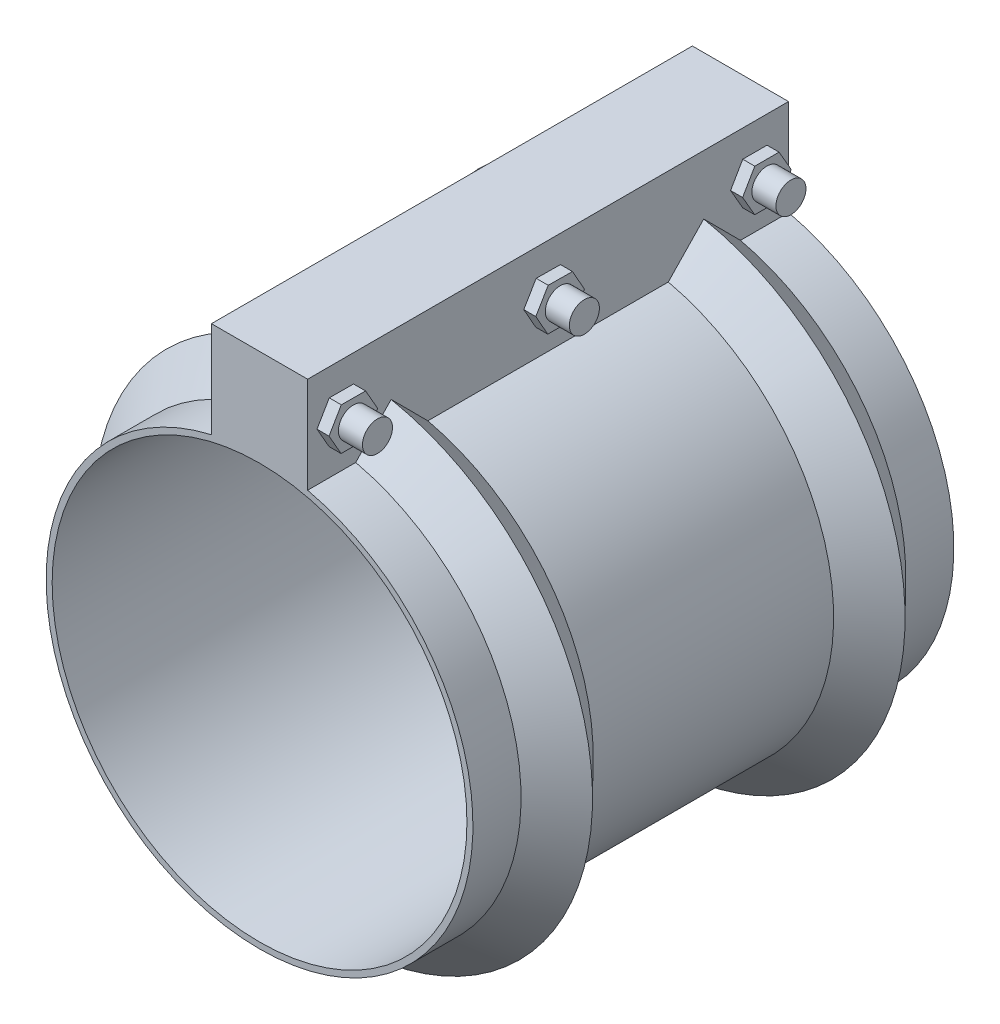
from build123d import *

# Parameters (mm, degrees)
BOSS_EXTRUDE1_DEPTH      = 127
BOSS_EXTRUDE1_DEPTH_BACK = 127
BOSS_EXTRUDE2_DEPTH      = 6.35
SKETCH4_R                = 7.9375
BOSS_EXTRUDE3_DEPTH      = 12.7
SKETCH5_R                = 11.1125
BOSS_EXTRUDE4_DEPTH      = 6.35
FILLET1_R                = 5.08


with BuildPart() as part:
    # Sketch1 → Revolve1 (revolve)
    with BuildSketch(Plane(origin=(0, 0, 0), x_dir=(0, 0, -1), z_dir=(1, 0, 0)), mode=Mode.PRIVATE) as revolve1_sk:
        Polygon((-127, 109.5375), (127, 109.5375), (127, 112.7125), (101.6, 112.7125), (82.19285338, 131.7625), (63.493427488, 112.7125), (-63.493427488, 112.7125), (-82.900574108, 131.7625), (-101.6, 112.7125), (-127, 112.7125), align=None)
    revolve(revolve1_sk.sketch.rotate(Axis((0, 0, 248.174311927), (0, 0, -1)), 90), axis=Axis((0, 0, 248.174311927), (0, 0, -1)))

    # Sketch2 → Boss-Extrude1 (add, two sides: drawn at the far end of the back side and taken through both)
    with BuildSketch(Plane.XY.offset(-BOSS_EXTRUDE1_DEPTH_BACK)):
        with BuildLine():
            Line((-25.4, 160.613239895), (25.4, 160.613239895))
            Line((25.4, 160.613239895), (25.4, 109.813239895))
            ThreePointArc((25.4, 109.813239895), (0, 112.7125), (-25.4, 109.813239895))
            Line((-25.4, 109.813239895), (-25.4, 160.613239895))
        make_face()
    extrude(amount=BOSS_EXTRUDE1_DEPTH + BOSS_EXTRUDE1_DEPTH_BACK)

    # Sketch3 → Boss-Extrude2 (add)
    with BuildSketch(Plane(origin=(25.4, 0, 0), x_dir=(0, 0, -1), z_dir=(1, 0, 0))):
        Polygon((-96.388561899, 135.14687273), (-102.746805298, 146.292407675), (-115.578243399, 146.35877484), (-122.051438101, 135.27960706), (-115.693194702, 124.134072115), (-102.861756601, 124.06770495), align=None)
        Polygon((12.830885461, 135.076907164), (6.533510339, 146.256946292), (-6.297375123, 146.393279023), (-12.830885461, 135.349572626), (-6.533510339, 124.169533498), (6.297375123, 124.033200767), align=None)
        Polygon((122.051609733, 135.213239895), (115.635804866, 146.325739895), (102.804195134, 146.325739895), (96.388390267, 135.213239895), (102.804195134, 124.100739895), (115.635804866, 124.100739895), align=None)
    extrude(amount=BOSS_EXTRUDE2_DEPTH)

    # Sketch4 → Boss-Extrude3 (add)
    with BuildSketch(Plane(origin=(31.75, 0, 0), x_dir=(0, 0, -1), z_dir=(1, 0, 0))):
        with Locations((-109.162524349, 135.14687273)):
            Circle(SKETCH4_R)
        with Locations((0.118067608, 135.076907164)):
            Circle(SKETCH4_R)
        with Locations((109.22, 135.213239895)):
            Circle(SKETCH4_R)
    extrude(amount=BOSS_EXTRUDE3_DEPTH)

    # Sketch5 → Boss-Extrude4 (add)
    with BuildSketch(Plane.ZY.offset(25.4)):
        with Locations(Location((-109.22, 135.213239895, 0), (0, 0, 270))):
            Circle(SKETCH5_R)
        with Locations(Location((0, 135.213239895, 0), (0, 0, 270))):
            Circle(SKETCH5_R)
        with Locations(Location((109.22, 135.213239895, 0), (0, 0, 270))):
            Circle(SKETCH5_R)
    extrude(amount=BOSS_EXTRUDE4_DEPTH)

    # Fillet1
    fillet1_edges = [part.edges().sort_by_distance(p)[0] for p in [
        (-31.75, 146.325739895, -109.22),
        (-31.75, 146.325739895, 0),
        (-31.75, 146.325739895, 109.22),
    ]]
    fillet(fillet1_edges, radius=FILLET1_R)


solid = part.part
